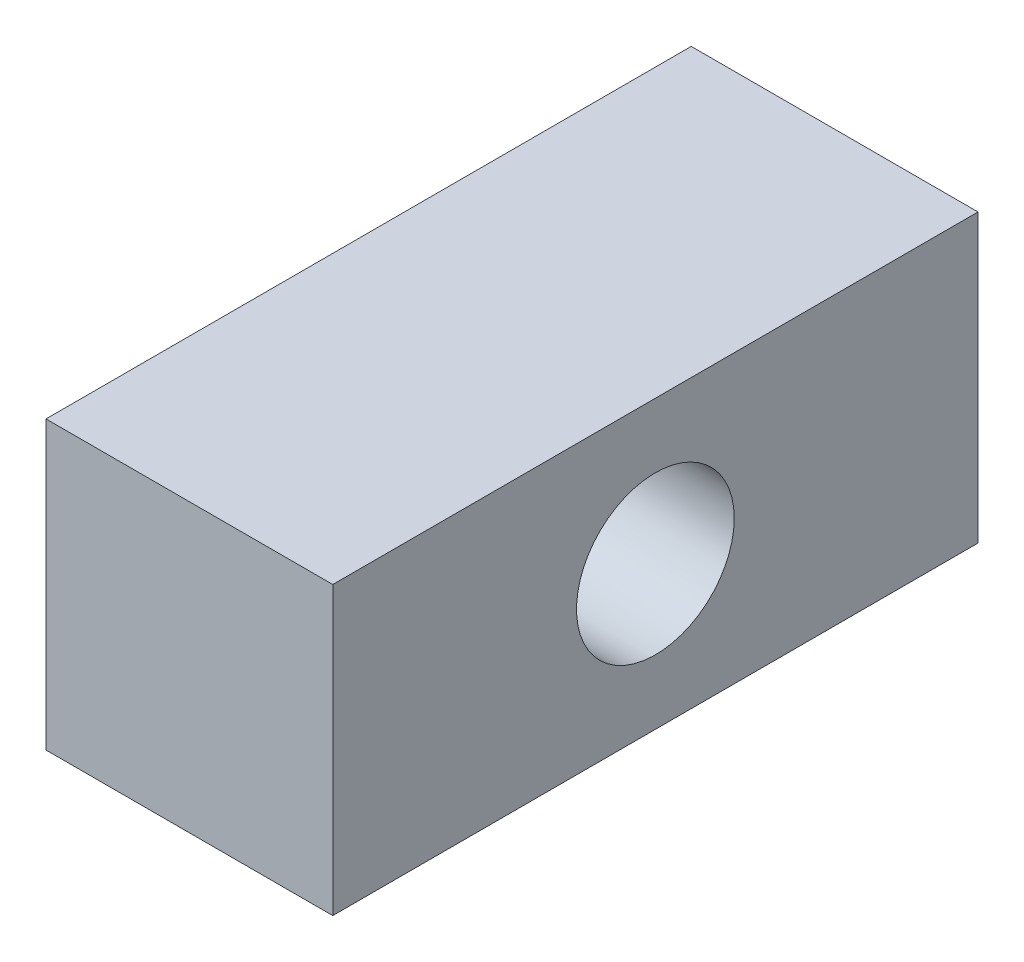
ISO-10303-21;
HEADER;
FILE_DESCRIPTION(('STEP AP214'),'2;1');
FILE_NAME('part.step','',(''),(''),'','','');
FILE_SCHEMA(('AUTOMOTIVE_DESIGN { 1 0 10303 214 1 1 1 1 }'));
ENDSEC;
DATA;
#1=APPLICATION_CONTEXT('core data for automotive mechanical design processes');
#2=APPLICATION_PROTOCOL_DEFINITION('international standard','automotive_design',2000,#1);
#3=PRODUCT_CONTEXT('',#1,'mechanical');
#4=PRODUCT('Part','Part','',(#3));
#5=PRODUCT_RELATED_PRODUCT_CATEGORY('part','',(#4));
#6=PRODUCT_DEFINITION_FORMATION('','',#4);
#7=PRODUCT_DEFINITION_CONTEXT('part definition',#1,'design');
#8=PRODUCT_DEFINITION('design','',#6,#7);
#9=PRODUCT_DEFINITION_SHAPE('','',#8);
#10=(LENGTH_UNIT() NAMED_UNIT(*) SI_UNIT(.MILLI.,.METRE.));
#11=(NAMED_UNIT(*) PLANE_ANGLE_UNIT() SI_UNIT($,.RADIAN.));
#12=(NAMED_UNIT(*) SI_UNIT($,.STERADIAN.) SOLID_ANGLE_UNIT());
#13=UNCERTAINTY_MEASURE_WITH_UNIT(LENGTH_MEASURE(1.E-05),#10,'distance_accuracy_value','');
#14=(GEOMETRIC_REPRESENTATION_CONTEXT(3) GLOBAL_UNCERTAINTY_ASSIGNED_CONTEXT((#13)) GLOBAL_UNIT_ASSIGNED_CONTEXT((#10,
#11,#12)) REPRESENTATION_CONTEXT('',''));
#15=CARTESIAN_POINT('',(0.,0.,0.));
#16=DIRECTION('',(0.,0.,1.));
#17=DIRECTION('',(1.,0.,0.));
#18=AXIS2_PLACEMENT_3D('',#15,#16,#17);
#19=CARTESIAN_POINT('',(30.,-18.4999999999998,0.));
#20=DIRECTION('',(0.,0.,-1.));
#21=DIRECTION('',(-1.,0.,0.));
#22=AXIS2_PLACEMENT_3D('',#19,#20,#21);
#23=PLANE('',#22);
#24=DIRECTION('',(0.,-1.,0.));
#25=VECTOR('',#24,1.);
#26=CARTESIAN_POINT('',(30.,-58.4999999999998,0.));
#27=LINE('',#26,#25);
#28=CARTESIAN_POINT('',(30.,-18.4999999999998,0.));
#29=VERTEX_POINT('',#28);
#30=CARTESIAN_POINT('',(30.,-58.4999999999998,0.));
#31=VERTEX_POINT('',#30);
#32=EDGE_CURVE('E80',#29,#31,#27,.T.);
#33=ORIENTED_EDGE('',*,*,#32,.F.);
#34=DIRECTION('',(-1.,0.,0.));
#35=VECTOR('',#34,1.);
#36=CARTESIAN_POINT('',(30.,-18.4999999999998,0.));
#37=LINE('',#36,#35);
#38=CARTESIAN_POINT('',(70.,-18.4999999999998,0.));
#39=VERTEX_POINT('',#38);
#40=EDGE_CURVE('E95',#39,#29,#37,.T.);
#41=ORIENTED_EDGE('',*,*,#40,.F.);
#42=DIRECTION('',(0.,1.,0.));
#43=VECTOR('',#42,1.);
#44=CARTESIAN_POINT('',(70.,-58.4999999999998,0.));
#45=LINE('',#44,#43);
#46=CARTESIAN_POINT('',(70.,-58.4999999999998,0.));
#47=VERTEX_POINT('',#46);
#48=EDGE_CURVE('E82',#47,#39,#45,.T.);
#49=ORIENTED_EDGE('',*,*,#48,.F.);
#50=DIRECTION('',(1.,0.,0.));
#51=VECTOR('',#50,1.);
#52=CARTESIAN_POINT('',(30.,-58.4999999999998,0.));
#53=LINE('',#52,#51);
#54=EDGE_CURVE('E72',#31,#47,#53,.T.);
#55=ORIENTED_EDGE('',*,*,#54,.F.);
#56=EDGE_LOOP('',(#33,#41,#49,#55));
#57=FACE_BOUND('',#56,.T.);
#58=ADVANCED_FACE('F31',(#57),#23,.T.);
#59=CARTESIAN_POINT('',(30.,-18.4999999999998,146.568542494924));
#60=DIRECTION('',(0.,-1.,0.));
#61=DIRECTION('',(0.,0.,-1.));
#62=AXIS2_PLACEMENT_3D('',#59,#60,#61);
#63=PLANE('',#62);
#64=DIRECTION('',(0.,0.,-1.));
#65=VECTOR('',#64,1.);
#66=CARTESIAN_POINT('',(30.,-18.4999999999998,146.568542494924));
#67=LINE('',#66,#65);
#68=CARTESIAN_POINT('',(30.,-18.4999999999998,90.));
#69=VERTEX_POINT('',#68);
#70=EDGE_CURVE('E85',#69,#29,#67,.T.);
#71=ORIENTED_EDGE('',*,*,#70,.F.);
#72=DIRECTION('',(1.,0.,0.));
#73=VECTOR('',#72,1.);
#74=CARTESIAN_POINT('',(30.,-18.4999999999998,90.));
#75=LINE('',#74,#73);
#76=CARTESIAN_POINT('',(70.,-18.4999999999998,90.));
#77=VERTEX_POINT('',#76);
#78=EDGE_CURVE('E35',#69,#77,#75,.T.);
#79=ORIENTED_EDGE('',*,*,#78,.T.);
#80=DIRECTION('',(0.,0.,-1.));
#81=VECTOR('',#80,1.);
#82=CARTESIAN_POINT('',(70.,-18.4999999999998,146.568542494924));
#83=LINE('',#82,#81);
#84=EDGE_CURVE('E98',#77,#39,#83,.T.);
#85=ORIENTED_EDGE('',*,*,#84,.T.);
#86=ORIENTED_EDGE('',*,*,#40,.T.);
#87=EDGE_LOOP('',(#71,#79,#85,#86));
#88=FACE_BOUND('',#87,.T.);
#89=ADVANCED_FACE('F114',(#88),#63,.F.);
#90=CARTESIAN_POINT('',(70.,-58.4999999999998,146.568542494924));
#91=DIRECTION('',(-1.,0.,0.));
#92=DIRECTION('',(0.,0.,1.));
#93=AXIS2_PLACEMENT_3D('',#90,#91,#92);
#94=PLANE('',#93);
#95=CARTESIAN_POINT('',(70.,-38.4999999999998,45.));
#96=DIRECTION('',(1.,0.,0.));
#97=DIRECTION('',(0.,0.,-1.));
#98=AXIS2_PLACEMENT_3D('',#95,#96,#97);
#99=CIRCLE('',#98,11.);
#100=CARTESIAN_POINT('',(70.,-38.4999999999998,34.));
#101=VERTEX_POINT('',#100);
#102=EDGE_CURVE('E90',#101,#101,#99,.T.);
#103=ORIENTED_EDGE('',*,*,#102,.F.);
#104=EDGE_LOOP('',(#103));
#105=FACE_BOUND('',#104,.T.);
#106=ORIENTED_EDGE('',*,*,#84,.F.);
#107=DIRECTION('',(0.,-1.,0.));
#108=VECTOR('',#107,1.);
#109=CARTESIAN_POINT('',(70.,-58.4999999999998,90.));
#110=LINE('',#109,#108);
#111=CARTESIAN_POINT('',(70.,-58.4999999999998,90.));
#112=VERTEX_POINT('',#111);
#113=EDGE_CURVE('E104',#77,#112,#110,.T.);
#114=ORIENTED_EDGE('',*,*,#113,.T.);
#115=DIRECTION('',(0.,0.,-1.));
#116=VECTOR('',#115,1.);
#117=CARTESIAN_POINT('',(70.,-58.4999999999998,146.568542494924));
#118=LINE('',#117,#116);
#119=EDGE_CURVE('E76',#112,#47,#118,.T.);
#120=ORIENTED_EDGE('',*,*,#119,.T.);
#121=ORIENTED_EDGE('',*,*,#48,.T.);
#122=EDGE_LOOP('',(#106,#114,#120,#121));
#123=FACE_BOUND('',#122,.T.);
#124=ADVANCED_FACE('F103',(#105,#123),#94,.F.);
#125=CARTESIAN_POINT('',(30.,-58.4999999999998,146.568542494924));
#126=DIRECTION('',(0.,1.,0.));
#127=DIRECTION('',(0.,0.,1.));
#128=AXIS2_PLACEMENT_3D('',#125,#126,#127);
#129=PLANE('',#128);
#130=ORIENTED_EDGE('',*,*,#119,.F.);
#131=DIRECTION('',(-1.,0.,0.));
#132=VECTOR('',#131,1.);
#133=CARTESIAN_POINT('',(30.,-58.4999999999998,90.));
#134=LINE('',#133,#132);
#135=CARTESIAN_POINT('',(30.,-58.4999999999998,90.));
#136=VERTEX_POINT('',#135);
#137=EDGE_CURVE('E40',#112,#136,#134,.T.);
#138=ORIENTED_EDGE('',*,*,#137,.T.);
#139=DIRECTION('',(0.,0.,-1.));
#140=VECTOR('',#139,1.);
#141=CARTESIAN_POINT('',(30.,-58.4999999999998,146.568542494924));
#142=LINE('',#141,#140);
#143=EDGE_CURVE('E69',#136,#31,#142,.T.);
#144=ORIENTED_EDGE('',*,*,#143,.T.);
#145=ORIENTED_EDGE('',*,*,#54,.T.);
#146=EDGE_LOOP('',(#130,#138,#144,#145));
#147=FACE_BOUND('',#146,.T.);
#148=ADVANCED_FACE('F71',(#147),#129,.F.);
#149=CARTESIAN_POINT('',(30.,-58.4999999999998,146.568542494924));
#150=DIRECTION('',(1.,0.,0.));
#151=DIRECTION('',(0.,0.,-1.));
#152=AXIS2_PLACEMENT_3D('',#149,#150,#151);
#153=PLANE('',#152);
#154=CARTESIAN_POINT('',(30.,-38.4999999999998,45.));
#155=DIRECTION('',(1.,0.,0.));
#156=DIRECTION('',(0.,0.,-1.));
#157=AXIS2_PLACEMENT_3D('',#154,#155,#156);
#158=CIRCLE('',#157,11.);
#159=CARTESIAN_POINT('',(30.,-38.4999999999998,34.));
#160=VERTEX_POINT('',#159);
#161=EDGE_CURVE('E87',#160,#160,#158,.T.);
#162=ORIENTED_EDGE('',*,*,#161,.T.);
#163=EDGE_LOOP('',(#162));
#164=FACE_BOUND('',#163,.T.);
#165=ORIENTED_EDGE('',*,*,#143,.F.);
#166=DIRECTION('',(0.,1.,0.));
#167=VECTOR('',#166,1.);
#168=CARTESIAN_POINT('',(30.,-58.4999999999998,90.));
#169=LINE('',#168,#167);
#170=EDGE_CURVE('E11',#136,#69,#169,.T.);
#171=ORIENTED_EDGE('',*,*,#170,.T.);
#172=ORIENTED_EDGE('',*,*,#70,.T.);
#173=ORIENTED_EDGE('',*,*,#32,.T.);
#174=EDGE_LOOP('',(#165,#171,#172,#173));
#175=FACE_BOUND('',#174,.T.);
#176=ADVANCED_FACE('F33',(#164,#175),#153,.F.);
#177=CARTESIAN_POINT('',(-60.,-1316.5,90.));
#178=DIRECTION('',(0.,0.,-1.));
#179=DIRECTION('',(0.,-1.,0.));
#180=AXIS2_PLACEMENT_3D('',#177,#178,#179);
#181=PLANE('',#180);
#182=ORIENTED_EDGE('',*,*,#137,.F.);
#183=ORIENTED_EDGE('',*,*,#113,.F.);
#184=ORIENTED_EDGE('',*,*,#78,.F.);
#185=ORIENTED_EDGE('',*,*,#170,.F.);
#186=EDGE_LOOP('',(#182,#183,#184,#185));
#187=FACE_BOUND('',#186,.T.);
#188=ADVANCED_FACE('F127',(#187),#181,.F.);
#189=CARTESIAN_POINT('',(70.,-38.4999999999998,45.));
#190=DIRECTION('',(1.,0.,0.));
#191=DIRECTION('',(0.,0.,-1.));
#192=AXIS2_PLACEMENT_3D('',#189,#190,#191);
#193=CYLINDRICAL_SURFACE('',#192,11.);
#194=ORIENTED_EDGE('',*,*,#161,.F.);
#195=EDGE_LOOP('',(#194));
#196=FACE_BOUND('',#195,.T.);
#197=ORIENTED_EDGE('',*,*,#102,.T.);
#198=EDGE_LOOP('',(#197));
#199=FACE_BOUND('',#198,.T.);
#200=ADVANCED_FACE('F111',(#196,#199),#193,.F.);
#201=CLOSED_SHELL('',(#58,#89,#124,#148,#176,#188,#200));
#202=MANIFOLD_SOLID_BREP('B2',#201);
#203=ADVANCED_BREP_SHAPE_REPRESENTATION('',(#18,#202),#14);
#204=SHAPE_DEFINITION_REPRESENTATION(#9,#203);
ENDSEC;
END-ISO-10303-21;
